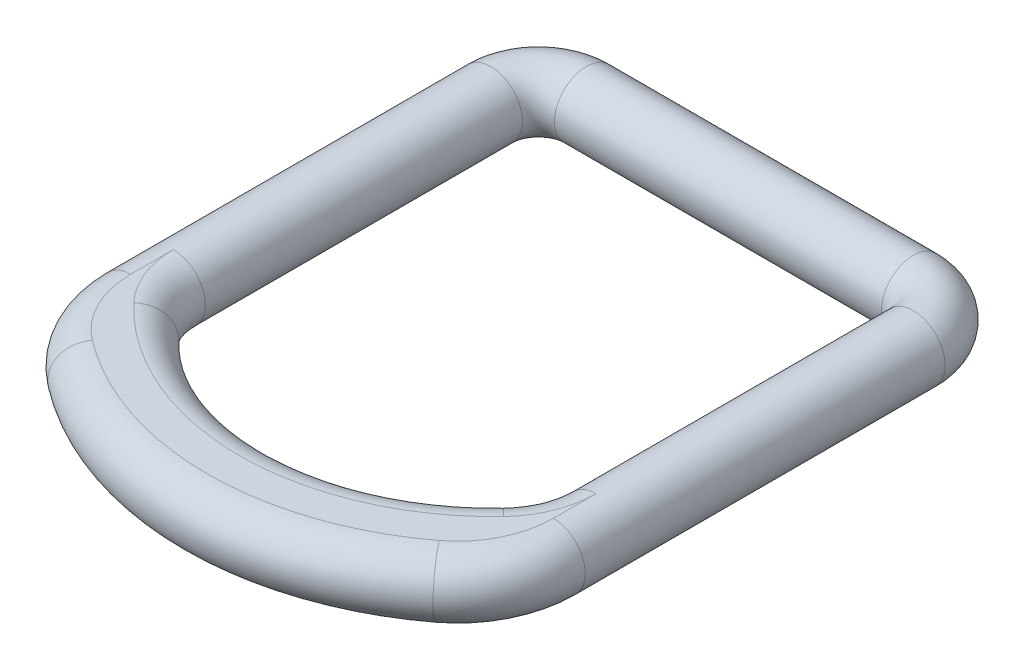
ISO-10303-21;
HEADER;
FILE_DESCRIPTION(('STEP AP214'),'2;1');
FILE_NAME('part.step','',(''),(''),'','','');
FILE_SCHEMA(('AUTOMOTIVE_DESIGN { 1 0 10303 214 1 1 1 1 }'));
ENDSEC;
DATA;
#1=APPLICATION_CONTEXT('core data for automotive mechanical design processes');
#2=APPLICATION_PROTOCOL_DEFINITION('international standard','automotive_design',2000,#1);
#3=PRODUCT_CONTEXT('',#1,'mechanical');
#4=PRODUCT('Part','Part','',(#3));
#5=PRODUCT_RELATED_PRODUCT_CATEGORY('part','',(#4));
#6=PRODUCT_DEFINITION_FORMATION('','',#4);
#7=PRODUCT_DEFINITION_CONTEXT('part definition',#1,'design');
#8=PRODUCT_DEFINITION('design','',#6,#7);
#9=PRODUCT_DEFINITION_SHAPE('','',#8);
#10=(LENGTH_UNIT() NAMED_UNIT(*) SI_UNIT(.MILLI.,.METRE.));
#11=(NAMED_UNIT(*) PLANE_ANGLE_UNIT() SI_UNIT($,.RADIAN.));
#12=(NAMED_UNIT(*) SI_UNIT($,.STERADIAN.) SOLID_ANGLE_UNIT());
#13=UNCERTAINTY_MEASURE_WITH_UNIT(LENGTH_MEASURE(1.E-05),#10,'distance_accuracy_value','');
#14=(GEOMETRIC_REPRESENTATION_CONTEXT(3) GLOBAL_UNCERTAINTY_ASSIGNED_CONTEXT((#13)) GLOBAL_UNIT_ASSIGNED_CONTEXT((#10,
#11,#12)) REPRESENTATION_CONTEXT('',''));
#15=CARTESIAN_POINT('',(0.,0.,0.));
#16=DIRECTION('',(0.,0.,1.));
#17=DIRECTION('',(1.,0.,0.));
#18=AXIS2_PLACEMENT_3D('',#15,#16,#17);
#19=CARTESIAN_POINT('',(-23.01748,6.35,81.1612518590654));
#20=DIRECTION('',(0.,1.,0.));
#21=DIRECTION('',(-1.,0.,0.));
#22=AXIS2_PLACEMENT_3D('',#19,#20,#21);
#23=PLANE('',#22);
#24=CARTESIAN_POINT('',(23.01748,6.35,72.6691132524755));
#25=DIRECTION('',(0.,1.,0.));
#26=DIRECTION('',(-1.,0.,0.));
#27=AXIS2_PLACEMENT_3D('',#24,#25,#26);
#28=CIRCLE('',#27,19.05);
#29=CARTESIAN_POINT('',(42.06748,6.35,72.6691132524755));
#30=VERTEX_POINT('',#29);
#31=CARTESIAN_POINT('',(36.827968,6.35,85.7905812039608));
#32=VERTEX_POINT('',#31);
#33=EDGE_CURVE('E23',#30,#32,#28,.F.);
#34=ORIENTED_EDGE('',*,*,#33,.T.);
#35=CARTESIAN_POINT('',(0.,6.35,50.8));
#36=DIRECTION('',(0.,1.,0.));
#37=DIRECTION('',(-1.,0.,0.));
#38=AXIS2_PLACEMENT_3D('',#35,#36,#37);
#39=CIRCLE('',#38,50.8);
#40=CARTESIAN_POINT('',(-36.827968,6.35,85.7905812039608));
#41=VERTEX_POINT('',#40);
#42=EDGE_CURVE('E9',#32,#41,#39,.F.);
#43=ORIENTED_EDGE('',*,*,#42,.T.);
#44=CARTESIAN_POINT('',(-23.01748,6.35,72.6691132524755));
#45=DIRECTION('',(0.,1.,0.));
#46=DIRECTION('',(-1.,0.,0.));
#47=AXIS2_PLACEMENT_3D('',#44,#45,#46);
#48=CIRCLE('',#47,19.05);
#49=CARTESIAN_POINT('',(-42.06748,6.35,72.6691132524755));
#50=VERTEX_POINT('',#49);
#51=EDGE_CURVE('E130',#41,#50,#48,.F.);
#52=ORIENTED_EDGE('',*,*,#51,.T.);
#53=DIRECTION('',(0.,0.,1.));
#54=VECTOR('',#53,1.);
#55=CARTESIAN_POINT('',(-42.06748,6.35,81.1612518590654));
#56=LINE('',#55,#54);
#57=CARTESIAN_POINT('',(-42.06748,6.35,81.1612518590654));
#58=VERTEX_POINT('',#57);
#59=EDGE_CURVE('E128',#50,#58,#56,.T.);
#60=ORIENTED_EDGE('',*,*,#59,.T.);
#61=CARTESIAN_POINT('',(-23.01748,6.35,81.1612518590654));
#62=DIRECTION('',(0.,1.,0.));
#63=DIRECTION('',(-1.,0.,0.));
#64=AXIS2_PLACEMENT_3D('',#61,#62,#63);
#65=CIRCLE('',#64,19.05);
#66=CARTESIAN_POINT('',(-34.52622,6.35,96.341877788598));
#67=VERTEX_POINT('',#66);
#68=EDGE_CURVE('E124',#58,#67,#65,.T.);
#69=ORIENTED_EDGE('',*,*,#68,.T.);
#70=CARTESIAN_POINT('',(0.,6.35,50.8));
#71=DIRECTION('',(0.,1.,0.));
#72=DIRECTION('',(-1.,0.,0.));
#73=AXIS2_PLACEMENT_3D('',#70,#71,#72);
#74=CIRCLE('',#73,57.15);
#75=CARTESIAN_POINT('',(34.52622,6.35,96.341877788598));
#76=VERTEX_POINT('',#75);
#77=EDGE_CURVE('E121',#67,#76,#74,.T.);
#78=ORIENTED_EDGE('',*,*,#77,.T.);
#79=CARTESIAN_POINT('',(23.01748,6.35,81.1612518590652));
#80=DIRECTION('',(0.,1.,0.));
#81=DIRECTION('',(-1.,0.,0.));
#82=AXIS2_PLACEMENT_3D('',#79,#80,#81);
#83=CIRCLE('',#82,19.05);
#84=CARTESIAN_POINT('',(42.06748,6.35,81.1612518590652));
#85=VERTEX_POINT('',#84);
#86=EDGE_CURVE('E83',#76,#85,#83,.T.);
#87=ORIENTED_EDGE('',*,*,#86,.T.);
#88=DIRECTION('',(0.,0.,-1.));
#89=VECTOR('',#88,1.);
#90=CARTESIAN_POINT('',(42.06748,6.35,9.525));
#91=LINE('',#90,#89);
#92=EDGE_CURVE('E126',#85,#30,#91,.T.);
#93=ORIENTED_EDGE('',*,*,#92,.T.);
#94=EDGE_LOOP('',(#34,#43,#52,#60,#69,#78,#87,#93));
#95=FACE_BOUND('',#94,.T.);
#96=ADVANCED_FACE('F14',(#95),#23,.T.);
#97=CARTESIAN_POINT('',(-23.01748,-6.35,81.1612518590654));
#98=DIRECTION('',(0.,1.,0.));
#99=DIRECTION('',(-1.,0.,0.));
#100=AXIS2_PLACEMENT_3D('',#97,#98,#99);
#101=PLANE('',#100);
#102=CARTESIAN_POINT('',(-23.01748,-6.35,72.6691132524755));
#103=DIRECTION('',(0.,1.,0.));
#104=DIRECTION('',(-1.,0.,0.));
#105=AXIS2_PLACEMENT_3D('',#102,#103,#104);
#106=CIRCLE('',#105,19.05);
#107=CARTESIAN_POINT('',(-42.06748,-6.35,72.6691132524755));
#108=VERTEX_POINT('',#107);
#109=CARTESIAN_POINT('',(-36.827968,-6.35,85.7905812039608));
#110=VERTEX_POINT('',#109);
#111=EDGE_CURVE('E116',#108,#110,#106,.T.);
#112=ORIENTED_EDGE('',*,*,#111,.T.);
#113=CARTESIAN_POINT('',(0.,-6.35,50.8));
#114=DIRECTION('',(0.,1.,0.));
#115=DIRECTION('',(-1.,0.,0.));
#116=AXIS2_PLACEMENT_3D('',#113,#114,#115);
#117=CIRCLE('',#116,50.8);
#118=CARTESIAN_POINT('',(36.827968,-6.35,85.7905812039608));
#119=VERTEX_POINT('',#118);
#120=EDGE_CURVE('E118',#110,#119,#117,.T.);
#121=ORIENTED_EDGE('',*,*,#120,.T.);
#122=CARTESIAN_POINT('',(23.01748,-6.35,72.6691132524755));
#123=DIRECTION('',(0.,1.,0.));
#124=DIRECTION('',(-1.,0.,0.));
#125=AXIS2_PLACEMENT_3D('',#122,#123,#124);
#126=CIRCLE('',#125,19.05);
#127=CARTESIAN_POINT('',(42.06748,-6.35,72.6691132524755));
#128=VERTEX_POINT('',#127);
#129=EDGE_CURVE('E114',#119,#128,#126,.T.);
#130=ORIENTED_EDGE('',*,*,#129,.T.);
#131=DIRECTION('',(0.,0.,-1.));
#132=VECTOR('',#131,1.);
#133=CARTESIAN_POINT('',(42.06748,-6.35,81.1612518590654));
#134=LINE('',#133,#132);
#135=CARTESIAN_POINT('',(42.06748,-6.35,81.1612518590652));
#136=VERTEX_POINT('',#135);
#137=EDGE_CURVE('E100',#128,#136,#134,.F.);
#138=ORIENTED_EDGE('',*,*,#137,.T.);
#139=CARTESIAN_POINT('',(23.01748,-6.35,81.1612518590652));
#140=DIRECTION('',(0.,1.,0.));
#141=DIRECTION('',(-1.,0.,0.));
#142=AXIS2_PLACEMENT_3D('',#139,#140,#141);
#143=CIRCLE('',#142,19.05);
#144=CARTESIAN_POINT('',(34.52622,-6.35,96.341877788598));
#145=VERTEX_POINT('',#144);
#146=EDGE_CURVE('E82',#136,#145,#143,.F.);
#147=ORIENTED_EDGE('',*,*,#146,.T.);
#148=CARTESIAN_POINT('',(0.,-6.35,50.8));
#149=DIRECTION('',(0.,1.,0.));
#150=DIRECTION('',(-1.,0.,0.));
#151=AXIS2_PLACEMENT_3D('',#148,#149,#150);
#152=CIRCLE('',#151,57.15);
#153=CARTESIAN_POINT('',(-34.52622,-6.35,96.341877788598));
#154=VERTEX_POINT('',#153);
#155=EDGE_CURVE('E96',#145,#154,#152,.F.);
#156=ORIENTED_EDGE('',*,*,#155,.T.);
#157=CARTESIAN_POINT('',(-23.01748,-6.35,81.1612518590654));
#158=DIRECTION('',(0.,1.,0.));
#159=DIRECTION('',(-1.,0.,0.));
#160=AXIS2_PLACEMENT_3D('',#157,#158,#159);
#161=CIRCLE('',#160,19.05);
#162=CARTESIAN_POINT('',(-42.06748,-6.35,81.1612518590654));
#163=VERTEX_POINT('',#162);
#164=EDGE_CURVE('E101',#154,#163,#161,.F.);
#165=ORIENTED_EDGE('',*,*,#164,.T.);
#166=DIRECTION('',(0.,0.,1.));
#167=VECTOR('',#166,1.);
#168=CARTESIAN_POINT('',(-42.06748,-6.35,81.1612518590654));
#169=LINE('',#168,#167);
#170=EDGE_CURVE('E111',#163,#108,#169,.F.);
#171=ORIENTED_EDGE('',*,*,#170,.T.);
#172=EDGE_LOOP('',(#112,#121,#130,#138,#147,#156,#165,#171));
#173=FACE_BOUND('',#172,.T.);
#174=ADVANCED_FACE('F94',(#173),#101,.F.);
#175=CARTESIAN_POINT('',(0.,0.,50.8));
#176=DIRECTION('',(0.,1.,0.));
#177=DIRECTION('',(-1.,0.,0.));
#178=AXIS2_PLACEMENT_3D('',#175,#176,#177);
#179=TOROIDAL_SURFACE('',#178,50.8,6.35);
#180=CARTESIAN_POINT('',(-36.827968,0.,85.7905812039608));
#181=DIRECTION('',(-0.688790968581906,0.,-0.72496));
#182=DIRECTION('',(-0.72496,0.,0.688790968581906));
#183=AXIS2_PLACEMENT_3D('',#180,#181,#182);
#184=CIRCLE('',#183,6.35);
#185=EDGE_CURVE('E87',#41,#110,#184,.T.);
#186=ORIENTED_EDGE('',*,*,#185,.F.);
#187=ORIENTED_EDGE('',*,*,#42,.F.);
#188=CARTESIAN_POINT('',(36.827968,0.,85.7905812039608));
#189=DIRECTION('',(0.688790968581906,0.,-0.72496));
#190=DIRECTION('',(-0.72496,0.,-0.688790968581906));
#191=AXIS2_PLACEMENT_3D('',#188,#189,#190);
#192=CIRCLE('',#191,6.35);
#193=EDGE_CURVE('E18',#119,#32,#192,.T.);
#194=ORIENTED_EDGE('',*,*,#193,.F.);
#195=ORIENTED_EDGE('',*,*,#120,.F.);
#196=EDGE_LOOP('',(#186,#187,#194,#195));
#197=FACE_BOUND('',#196,.T.);
#198=ADVANCED_FACE('F16',(#197),#179,.T.);
#199=CARTESIAN_POINT('',(23.01748,0.,72.6691132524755));
#200=DIRECTION('',(0.,1.,0.));
#201=DIRECTION('',(-1.,0.,0.));
#202=AXIS2_PLACEMENT_3D('',#199,#200,#201);
#203=TOROIDAL_SURFACE('',#202,19.05,6.35);
#204=ORIENTED_EDGE('',*,*,#193,.T.);
#205=ORIENTED_EDGE('',*,*,#33,.F.);
#206=CARTESIAN_POINT('',(42.06748,0.,72.6691132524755));
#207=DIRECTION('',(0.,0.,-1.));
#208=DIRECTION('',(0.,-1.,0.));
#209=AXIS2_PLACEMENT_3D('',#206,#207,#208);
#210=CIRCLE('',#209,6.35);
#211=EDGE_CURVE('E88',#128,#30,#210,.T.);
#212=ORIENTED_EDGE('',*,*,#211,.F.);
#213=ORIENTED_EDGE('',*,*,#129,.F.);
#214=EDGE_LOOP('',(#204,#205,#212,#213));
#215=FACE_BOUND('',#214,.T.);
#216=ADVANCED_FACE('F164',(#215),#203,.T.);
#217=CARTESIAN_POINT('',(0.,0.,50.8));
#218=DIRECTION('',(0.,1.,0.));
#219=DIRECTION('',(-1.,0.,0.));
#220=AXIS2_PLACEMENT_3D('',#217,#218,#219);
#221=TOROIDAL_SURFACE('',#220,57.15,6.35);
#222=CARTESIAN_POINT('',(34.52622,0.,96.341877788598));
#223=DIRECTION('',(0.796883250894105,0.,-0.604133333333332));
#224=DIRECTION('',(-0.604133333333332,0.,-0.796883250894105));
#225=AXIS2_PLACEMENT_3D('',#222,#223,#224);
#226=CIRCLE('',#225,6.35);
#227=EDGE_CURVE('E78',#76,#145,#226,.T.);
#228=ORIENTED_EDGE('',*,*,#227,.F.);
#229=ORIENTED_EDGE('',*,*,#77,.F.);
#230=CARTESIAN_POINT('',(-34.52622,0.,96.341877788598));
#231=DIRECTION('',(-0.796883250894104,0.,-0.604133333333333));
#232=DIRECTION('',(-0.604133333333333,0.,0.796883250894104));
#233=AXIS2_PLACEMENT_3D('',#230,#231,#232);
#234=CIRCLE('',#233,6.35);
#235=EDGE_CURVE('E105',#154,#67,#234,.T.);
#236=ORIENTED_EDGE('',*,*,#235,.F.);
#237=ORIENTED_EDGE('',*,*,#155,.F.);
#238=EDGE_LOOP('',(#228,#229,#236,#237));
#239=FACE_BOUND('',#238,.T.);
#240=ADVANCED_FACE('F103',(#239),#221,.T.);
#241=CARTESIAN_POINT('',(-23.01748,0.,72.6691132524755));
#242=DIRECTION('',(0.,1.,0.));
#243=DIRECTION('',(-1.,0.,0.));
#244=AXIS2_PLACEMENT_3D('',#241,#242,#243);
#245=TOROIDAL_SURFACE('',#244,19.05,6.35);
#246=ORIENTED_EDGE('',*,*,#51,.F.);
#247=ORIENTED_EDGE('',*,*,#185,.T.);
#248=ORIENTED_EDGE('',*,*,#111,.F.);
#249=CARTESIAN_POINT('',(-42.06748,0.,72.6691132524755));
#250=DIRECTION('',(0.,0.,-1.));
#251=DIRECTION('',(0.,-1.,0.));
#252=AXIS2_PLACEMENT_3D('',#249,#250,#251);
#253=CIRCLE('',#252,6.35);
#254=EDGE_CURVE('E150',#50,#108,#253,.T.);
#255=ORIENTED_EDGE('',*,*,#254,.F.);
#256=EDGE_LOOP('',(#246,#247,#248,#255));
#257=FACE_BOUND('',#256,.T.);
#258=ADVANCED_FACE('F157',(#257),#245,.T.);
#259=CARTESIAN_POINT('',(23.01748,0.,81.1612518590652));
#260=DIRECTION('',(0.,1.,0.));
#261=DIRECTION('',(-1.,0.,0.));
#262=AXIS2_PLACEMENT_3D('',#259,#260,#261);
#263=TOROIDAL_SURFACE('',#262,19.05,6.35);
#264=ORIENTED_EDGE('',*,*,#86,.F.);
#265=ORIENTED_EDGE('',*,*,#227,.T.);
#266=ORIENTED_EDGE('',*,*,#146,.F.);
#267=CARTESIAN_POINT('',(42.06748,0.,81.1612518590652));
#268=DIRECTION('',(0.,0.,-1.));
#269=DIRECTION('',(0.,-1.,0.));
#270=AXIS2_PLACEMENT_3D('',#267,#268,#269);
#271=CIRCLE('',#270,6.35);
#272=EDGE_CURVE('E148',#85,#136,#271,.T.);
#273=ORIENTED_EDGE('',*,*,#272,.F.);
#274=EDGE_LOOP('',(#264,#265,#266,#273));
#275=FACE_BOUND('',#274,.T.);
#276=ADVANCED_FACE('F80',(#275),#263,.T.);
#277=CARTESIAN_POINT('',(42.06748,0.,9.525));
#278=DIRECTION('',(0.,0.,-1.));
#279=DIRECTION('',(-1.,0.,0.));
#280=AXIS2_PLACEMENT_3D('',#277,#278,#279);
#281=CYLINDRICAL_SURFACE('',#280,6.35);
#282=ORIENTED_EDGE('',*,*,#272,.T.);
#283=ORIENTED_EDGE('',*,*,#137,.F.);
#284=ORIENTED_EDGE('',*,*,#211,.T.);
#285=ORIENTED_EDGE('',*,*,#92,.F.);
#286=EDGE_LOOP('',(#282,#283,#284,#285));
#287=FACE_BOUND('',#286,.T.);
#288=CARTESIAN_POINT('',(42.06748,0.,9.525));
#289=DIRECTION('',(0.,0.,-1.));
#290=DIRECTION('',(0.,-1.,0.));
#291=AXIS2_PLACEMENT_3D('',#288,#289,#290);
#292=CIRCLE('',#291,6.35);
#293=CARTESIAN_POINT('',(48.41748,0.,9.525));
#294=VERTEX_POINT('',#293);
#295=EDGE_CURVE('E145',#294,#294,#292,.T.);
#296=ORIENTED_EDGE('',*,*,#295,.F.);
#297=EDGE_LOOP('',(#296));
#298=FACE_BOUND('',#297,.T.);
#299=ADVANCED_FACE('F167',(#287,#298),#281,.T.);
#300=CARTESIAN_POINT('',(-23.01748,0.,81.1612518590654));
#301=DIRECTION('',(0.,1.,0.));
#302=DIRECTION('',(-1.,0.,0.));
#303=AXIS2_PLACEMENT_3D('',#300,#301,#302);
#304=TOROIDAL_SURFACE('',#303,19.05,6.35);
#305=ORIENTED_EDGE('',*,*,#235,.T.);
#306=ORIENTED_EDGE('',*,*,#68,.F.);
#307=CARTESIAN_POINT('',(-42.06748,0.,81.1612518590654));
#308=DIRECTION('',(0.,0.,-1.));
#309=DIRECTION('',(0.,-1.,0.));
#310=AXIS2_PLACEMENT_3D('',#307,#308,#309);
#311=CIRCLE('',#310,6.35);
#312=EDGE_CURVE('E142',#163,#58,#311,.T.);
#313=ORIENTED_EDGE('',*,*,#312,.F.);
#314=ORIENTED_EDGE('',*,*,#164,.F.);
#315=EDGE_LOOP('',(#305,#306,#313,#314));
#316=FACE_BOUND('',#315,.T.);
#317=ADVANCED_FACE('F171',(#316),#304,.T.);
#318=CARTESIAN_POINT('',(-42.06748,0.,9.525));
#319=DIRECTION('',(0.,0.,1.));
#320=DIRECTION('',(1.,0.,0.));
#321=AXIS2_PLACEMENT_3D('',#318,#319,#320);
#322=CYLINDRICAL_SURFACE('',#321,6.35);
#323=ORIENTED_EDGE('',*,*,#254,.T.);
#324=ORIENTED_EDGE('',*,*,#170,.F.);
#325=ORIENTED_EDGE('',*,*,#312,.T.);
#326=ORIENTED_EDGE('',*,*,#59,.F.);
#327=EDGE_LOOP('',(#323,#324,#325,#326));
#328=FACE_BOUND('',#327,.T.);
#329=CARTESIAN_POINT('',(-42.06748,0.,9.525));
#330=DIRECTION('',(0.,0.,-1.));
#331=DIRECTION('',(-1.,0.,0.));
#332=AXIS2_PLACEMENT_3D('',#329,#330,#331);
#333=CIRCLE('',#332,6.35);
#334=CARTESIAN_POINT('',(-48.41748,0.,9.525));
#335=VERTEX_POINT('',#334);
#336=EDGE_CURVE('E139',#335,#335,#333,.T.);
#337=ORIENTED_EDGE('',*,*,#336,.F.);
#338=EDGE_LOOP('',(#337));
#339=FACE_BOUND('',#338,.T.);
#340=ADVANCED_FACE('F173',(#328,#339),#322,.T.);
#341=CARTESIAN_POINT('',(32.54248,0.,9.525));
#342=DIRECTION('',(0.,1.,0.));
#343=DIRECTION('',(-1.,0.,0.));
#344=AXIS2_PLACEMENT_3D('',#341,#342,#343);
#345=TOROIDAL_SURFACE('',#344,9.525,6.35);
#346=CARTESIAN_POINT('',(32.54248,0.,0.));
#347=DIRECTION('',(-1.,0.,0.));
#348=DIRECTION('',(0.,0.,1.));
#349=AXIS2_PLACEMENT_3D('',#346,#347,#348);
#350=CIRCLE('',#349,6.35);
#351=CARTESIAN_POINT('',(32.54248,0.,-6.35));
#352=VERTEX_POINT('',#351);
#353=EDGE_CURVE('E136',#352,#352,#350,.T.);
#354=CARTESIAN_POINT('',(32.54248,0.,9.525));
#355=DIRECTION('',(0.,1.,0.));
#356=DIRECTION('',(-1.,0.,0.));
#357=AXIS2_PLACEMENT_3D('',#354,#355,#356);
#358=CIRCLE('',#357,15.875);
#359=EDGE_CURVE('',#294,#352,#358,.T.);
#360=ORIENTED_EDGE('',*,*,#295,.T.);
#361=ORIENTED_EDGE('',*,*,#353,.F.);
#362=ORIENTED_EDGE('',*,*,#359,.T.);
#363=ORIENTED_EDGE('',*,*,#359,.F.);
#364=EDGE_LOOP('',(#360,#362,#361,#363));
#365=FACE_BOUND('',#364,.T.);
#366=ADVANCED_FACE('F176',(#365),#345,.T.);
#367=CARTESIAN_POINT('',(-32.54248,0.,9.525));
#368=DIRECTION('',(0.,1.,0.));
#369=DIRECTION('',(-1.,0.,0.));
#370=AXIS2_PLACEMENT_3D('',#367,#368,#369);
#371=TOROIDAL_SURFACE('',#370,9.525,6.35);
#372=CARTESIAN_POINT('',(-32.54248,0.,0.));
#373=DIRECTION('',(1.,0.,0.));
#374=DIRECTION('',(0.,0.,-1.));
#375=AXIS2_PLACEMENT_3D('',#372,#373,#374);
#376=CIRCLE('',#375,6.35);
#377=CARTESIAN_POINT('',(-32.54248,0.,-6.35));
#378=VERTEX_POINT('',#377);
#379=EDGE_CURVE('E133',#378,#378,#376,.T.);
#380=CARTESIAN_POINT('',(-32.54248,0.,9.525));
#381=DIRECTION('',(0.,1.,0.));
#382=DIRECTION('',(-1.,0.,0.));
#383=AXIS2_PLACEMENT_3D('',#380,#381,#382);
#384=CIRCLE('',#383,15.875);
#385=EDGE_CURVE('',#378,#335,#384,.T.);
#386=ORIENTED_EDGE('',*,*,#379,.F.);
#387=ORIENTED_EDGE('',*,*,#336,.T.);
#388=ORIENTED_EDGE('',*,*,#385,.T.);
#389=ORIENTED_EDGE('',*,*,#385,.F.);
#390=EDGE_LOOP('',(#386,#388,#387,#389));
#391=FACE_BOUND('',#390,.T.);
#392=ADVANCED_FACE('F180',(#391),#371,.T.);
#393=CARTESIAN_POINT('',(32.54248,0.,0.));
#394=DIRECTION('',(-1.,0.,0.));
#395=DIRECTION('',(0.,0.,1.));
#396=AXIS2_PLACEMENT_3D('',#393,#394,#395);
#397=CYLINDRICAL_SURFACE('',#396,6.35);
#398=ORIENTED_EDGE('',*,*,#353,.T.);
#399=EDGE_LOOP('',(#398));
#400=FACE_BOUND('',#399,.T.);
#401=ORIENTED_EDGE('',*,*,#379,.T.);
#402=EDGE_LOOP('',(#401));
#403=FACE_BOUND('',#402,.T.);
#404=ADVANCED_FACE('F183',(#400,#403),#397,.T.);
#405=CLOSED_SHELL('',(#96,#174,#198,#216,#240,#258,#276,#299,#317,#340,#366,#392,#404));
#406=MANIFOLD_SOLID_BREP('B1',#405);
#407=ADVANCED_BREP_SHAPE_REPRESENTATION('',(#18,#406),#14);
#408=SHAPE_DEFINITION_REPRESENTATION(#9,#407);
ENDSEC;
END-ISO-10303-21;
